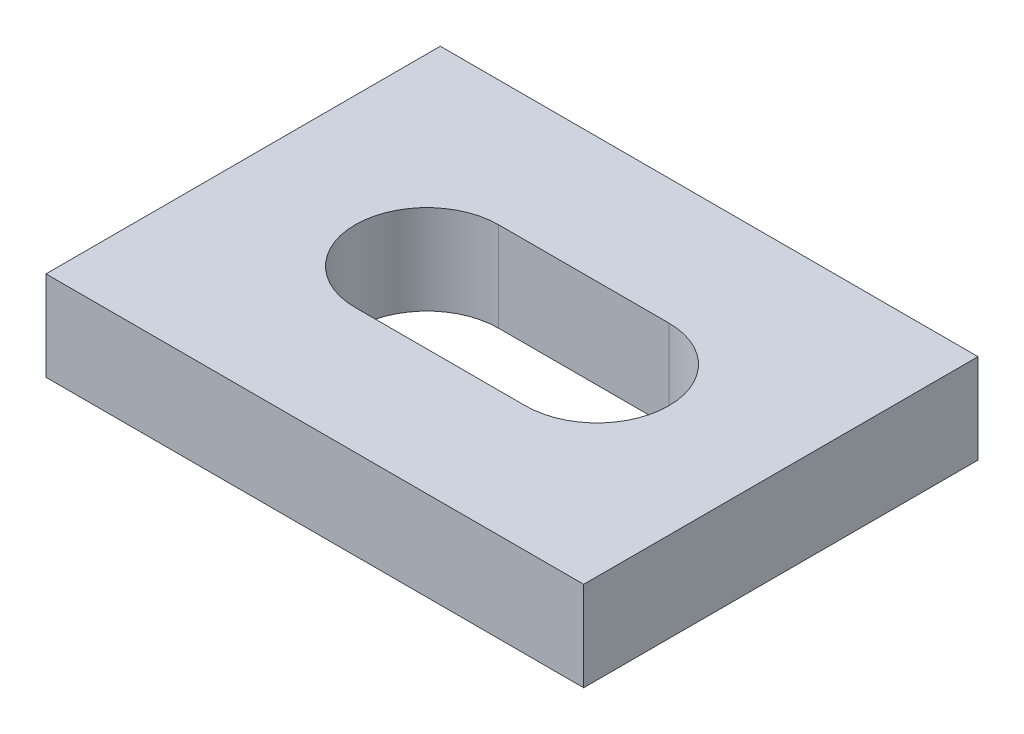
ISO-10303-21;
HEADER;
FILE_DESCRIPTION(('STEP AP214'),'2;1');
FILE_NAME('part.step','',(''),(''),'','','');
FILE_SCHEMA(('AUTOMOTIVE_DESIGN { 1 0 10303 214 1 1 1 1 }'));
ENDSEC;
DATA;
#1=APPLICATION_CONTEXT('core data for automotive mechanical design processes');
#2=APPLICATION_PROTOCOL_DEFINITION('international standard','automotive_design',2000,#1);
#3=PRODUCT_CONTEXT('',#1,'mechanical');
#4=PRODUCT('Part','Part','',(#3));
#5=PRODUCT_RELATED_PRODUCT_CATEGORY('part','',(#4));
#6=PRODUCT_DEFINITION_FORMATION('','',#4);
#7=PRODUCT_DEFINITION_CONTEXT('part definition',#1,'design');
#8=PRODUCT_DEFINITION('design','',#6,#7);
#9=PRODUCT_DEFINITION_SHAPE('','',#8);
#10=(LENGTH_UNIT() NAMED_UNIT(*) SI_UNIT(.MILLI.,.METRE.));
#11=(NAMED_UNIT(*) PLANE_ANGLE_UNIT() SI_UNIT($,.RADIAN.));
#12=(NAMED_UNIT(*) SI_UNIT($,.STERADIAN.) SOLID_ANGLE_UNIT());
#13=UNCERTAINTY_MEASURE_WITH_UNIT(LENGTH_MEASURE(1.E-05),#10,'distance_accuracy_value','');
#14=(GEOMETRIC_REPRESENTATION_CONTEXT(3) GLOBAL_UNCERTAINTY_ASSIGNED_CONTEXT((#13)) GLOBAL_UNIT_ASSIGNED_CONTEXT((#10,
#11,#12)) REPRESENTATION_CONTEXT('',''));
#15=CARTESIAN_POINT('',(0.,0.,0.));
#16=DIRECTION('',(0.,0.,1.));
#17=DIRECTION('',(1.,0.,0.));
#18=AXIS2_PLACEMENT_3D('',#15,#16,#17);
#19=CARTESIAN_POINT('',(-30.,10.,22.));
#20=DIRECTION('',(1.,0.,0.));
#21=DIRECTION('',(0.,0.,-1.));
#22=AXIS2_PLACEMENT_3D('',#19,#20,#21);
#23=PLANE('',#22);
#24=DIRECTION('',(0.,0.,1.));
#25=VECTOR('',#24,1.);
#26=CARTESIAN_POINT('',(-30.,0.,22.));
#27=LINE('',#26,#25);
#28=CARTESIAN_POINT('',(-30.,0.,-22.));
#29=VERTEX_POINT('',#28);
#30=CARTESIAN_POINT('',(-30.,0.,22.));
#31=VERTEX_POINT('',#30);
#32=EDGE_CURVE('E102',#29,#31,#27,.T.);
#33=ORIENTED_EDGE('',*,*,#32,.T.);
#34=DIRECTION('',(0.,-1.,0.));
#35=VECTOR('',#34,1.);
#36=CARTESIAN_POINT('',(-30.,10.,22.));
#37=LINE('',#36,#35);
#38=CARTESIAN_POINT('',(-30.,10.,22.));
#39=VERTEX_POINT('',#38);
#40=EDGE_CURVE('E11',#39,#31,#37,.T.);
#41=ORIENTED_EDGE('',*,*,#40,.F.);
#42=DIRECTION('',(0.,0.,1.));
#43=VECTOR('',#42,1.);
#44=CARTESIAN_POINT('',(-30.,10.,22.));
#45=LINE('',#44,#43);
#46=CARTESIAN_POINT('',(-30.,10.,-22.));
#47=VERTEX_POINT('',#46);
#48=EDGE_CURVE('E139',#47,#39,#45,.T.);
#49=ORIENTED_EDGE('',*,*,#48,.F.);
#50=DIRECTION('',(0.,-1.,0.));
#51=VECTOR('',#50,1.);
#52=CARTESIAN_POINT('',(-30.,10.,-22.));
#53=LINE('',#52,#51);
#54=EDGE_CURVE('E148',#47,#29,#53,.T.);
#55=ORIENTED_EDGE('',*,*,#54,.T.);
#56=EDGE_LOOP('',(#33,#41,#49,#55));
#57=FACE_BOUND('',#56,.T.);
#58=ADVANCED_FACE('F32',(#57),#23,.F.);
#59=CARTESIAN_POINT('',(-30.,10.,22.));
#60=DIRECTION('',(0.,0.,-1.));
#61=DIRECTION('',(-1.,0.,0.));
#62=AXIS2_PLACEMENT_3D('',#59,#60,#61);
#63=PLANE('',#62);
#64=DIRECTION('',(1.,0.,0.));
#65=VECTOR('',#64,1.);
#66=CARTESIAN_POINT('',(-30.,0.,22.));
#67=LINE('',#66,#65);
#68=CARTESIAN_POINT('',(30.,0.,22.));
#69=VERTEX_POINT('',#68);
#70=EDGE_CURVE('E133',#31,#69,#67,.T.);
#71=ORIENTED_EDGE('',*,*,#70,.T.);
#72=DIRECTION('',(0.,-1.,0.));
#73=VECTOR('',#72,1.);
#74=CARTESIAN_POINT('',(30.,10.,22.));
#75=LINE('',#74,#73);
#76=CARTESIAN_POINT('',(30.,10.,22.));
#77=VERTEX_POINT('',#76);
#78=EDGE_CURVE('E39',#77,#69,#75,.T.);
#79=ORIENTED_EDGE('',*,*,#78,.F.);
#80=DIRECTION('',(1.,0.,0.));
#81=VECTOR('',#80,1.);
#82=CARTESIAN_POINT('',(-30.,10.,22.));
#83=LINE('',#82,#81);
#84=EDGE_CURVE('E142',#39,#77,#83,.T.);
#85=ORIENTED_EDGE('',*,*,#84,.F.);
#86=ORIENTED_EDGE('',*,*,#40,.T.);
#87=EDGE_LOOP('',(#71,#79,#85,#86));
#88=FACE_BOUND('',#87,.T.);
#89=ADVANCED_FACE('F172',(#88),#63,.F.);
#90=CARTESIAN_POINT('',(30.,10.,22.));
#91=DIRECTION('',(-1.,0.,0.));
#92=DIRECTION('',(0.,0.,1.));
#93=AXIS2_PLACEMENT_3D('',#90,#91,#92);
#94=PLANE('',#93);
#95=DIRECTION('',(0.,0.,-1.));
#96=VECTOR('',#95,1.);
#97=CARTESIAN_POINT('',(30.,0.,22.));
#98=LINE('',#97,#96);
#99=CARTESIAN_POINT('',(30.,0.,-22.));
#100=VERTEX_POINT('',#99);
#101=EDGE_CURVE('E135',#69,#100,#98,.T.);
#102=ORIENTED_EDGE('',*,*,#101,.T.);
#103=DIRECTION('',(0.,-1.,0.));
#104=VECTOR('',#103,1.);
#105=CARTESIAN_POINT('',(30.,10.,-22.));
#106=LINE('',#105,#104);
#107=CARTESIAN_POINT('',(30.,10.,-22.));
#108=VERTEX_POINT('',#107);
#109=EDGE_CURVE('E151',#108,#100,#106,.T.);
#110=ORIENTED_EDGE('',*,*,#109,.F.);
#111=DIRECTION('',(0.,0.,-1.));
#112=VECTOR('',#111,1.);
#113=CARTESIAN_POINT('',(30.,10.,22.));
#114=LINE('',#113,#112);
#115=EDGE_CURVE('E144',#77,#108,#114,.T.);
#116=ORIENTED_EDGE('',*,*,#115,.F.);
#117=ORIENTED_EDGE('',*,*,#78,.T.);
#118=EDGE_LOOP('',(#102,#110,#116,#117));
#119=FACE_BOUND('',#118,.T.);
#120=ADVANCED_FACE('F158',(#119),#94,.F.);
#121=CARTESIAN_POINT('',(-30.,10.,-22.));
#122=DIRECTION('',(0.,0.,1.));
#123=DIRECTION('',(1.,0.,0.));
#124=AXIS2_PLACEMENT_3D('',#121,#122,#123);
#125=PLANE('',#124);
#126=DIRECTION('',(-1.,0.,0.));
#127=VECTOR('',#126,1.);
#128=CARTESIAN_POINT('',(-30.,0.,-22.));
#129=LINE('',#128,#127);
#130=EDGE_CURVE('E137',#100,#29,#129,.T.);
#131=ORIENTED_EDGE('',*,*,#130,.T.);
#132=ORIENTED_EDGE('',*,*,#54,.F.);
#133=DIRECTION('',(-1.,0.,0.));
#134=VECTOR('',#133,1.);
#135=CARTESIAN_POINT('',(-30.,10.,-22.));
#136=LINE('',#135,#134);
#137=EDGE_CURVE('E146',#108,#47,#136,.T.);
#138=ORIENTED_EDGE('',*,*,#137,.F.);
#139=ORIENTED_EDGE('',*,*,#109,.T.);
#140=EDGE_LOOP('',(#131,#132,#138,#139));
#141=FACE_BOUND('',#140,.T.);
#142=ADVANCED_FACE('F165',(#141),#125,.F.);
#143=CARTESIAN_POINT('',(-30.,10.,22.));
#144=DIRECTION('',(0.,-1.,0.));
#145=DIRECTION('',(0.,0.,-1.));
#146=AXIS2_PLACEMENT_3D('',#143,#144,#145);
#147=PLANE('',#146);
#148=DIRECTION('',(-1.,0.,0.));
#149=VECTOR('',#148,1.);
#150=CARTESIAN_POINT('',(9.50000000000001,9.99999999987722,-7.99999999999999));
#151=LINE('',#150,#149);
#152=CARTESIAN_POINT('',(9.50000000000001,10.,-7.99999999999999));
#153=VERTEX_POINT('',#152);
#154=CARTESIAN_POINT('',(-9.49999999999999,9.99999999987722,-8.));
#155=VERTEX_POINT('',#154);
#156=EDGE_CURVE('E115',#153,#155,#151,.T.);
#157=ORIENTED_EDGE('',*,*,#156,.F.);
#158=CARTESIAN_POINT('',(9.50000000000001,9.99999999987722,0.));
#159=DIRECTION('',(0.,1.,0.));
#160=DIRECTION('',(0.,0.,1.));
#161=AXIS2_PLACEMENT_3D('',#158,#159,#160);
#162=CIRCLE('',#161,8.);
#163=CARTESIAN_POINT('',(9.50000000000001,9.99999999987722,8.00000000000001));
#164=VERTEX_POINT('',#163);
#165=EDGE_CURVE('E46',#164,#153,#162,.T.);
#166=ORIENTED_EDGE('',*,*,#165,.F.);
#167=DIRECTION('',(1.,0.,0.));
#168=VECTOR('',#167,1.);
#169=CARTESIAN_POINT('',(-9.5,9.99999999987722,8.));
#170=LINE('',#169,#168);
#171=CARTESIAN_POINT('',(-9.49999999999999,9.99999999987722,8.));
#172=VERTEX_POINT('',#171);
#173=EDGE_CURVE('E108',#172,#164,#170,.T.);
#174=ORIENTED_EDGE('',*,*,#173,.F.);
#175=CARTESIAN_POINT('',(-9.49999999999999,9.99999999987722,0.));
#176=DIRECTION('',(0.,1.,0.));
#177=DIRECTION('',(0.,0.,1.));
#178=AXIS2_PLACEMENT_3D('',#175,#176,#177);
#179=CIRCLE('',#178,8.);
#180=EDGE_CURVE('E122',#155,#172,#179,.T.);
#181=ORIENTED_EDGE('',*,*,#180,.F.);
#182=EDGE_LOOP('',(#157,#166,#174,#181));
#183=FACE_BOUND('',#182,.T.);
#184=ORIENTED_EDGE('',*,*,#48,.T.);
#185=ORIENTED_EDGE('',*,*,#84,.T.);
#186=ORIENTED_EDGE('',*,*,#115,.T.);
#187=ORIENTED_EDGE('',*,*,#137,.T.);
#188=EDGE_LOOP('',(#184,#185,#186,#187));
#189=FACE_BOUND('',#188,.T.);
#190=ADVANCED_FACE('F171',(#183,#189),#147,.F.);
#191=CARTESIAN_POINT('',(-30.,0.,22.));
#192=DIRECTION('',(0.,-1.,0.));
#193=DIRECTION('',(0.,0.,-1.));
#194=AXIS2_PLACEMENT_3D('',#191,#192,#193);
#195=PLANE('',#194);
#196=CARTESIAN_POINT('',(9.50000000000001,0.,0.));
#197=DIRECTION('',(0.,-1.,0.));
#198=DIRECTION('',(0.,0.,-1.));
#199=AXIS2_PLACEMENT_3D('',#196,#197,#198);
#200=CIRCLE('',#199,8.);
#201=CARTESIAN_POINT('',(9.50000000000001,0.,8.00000000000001));
#202=VERTEX_POINT('',#201);
#203=CARTESIAN_POINT('',(9.50000000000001,0.,-7.99999999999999));
#204=VERTEX_POINT('',#203);
#205=EDGE_CURVE('E106',#202,#204,#200,.F.);
#206=ORIENTED_EDGE('',*,*,#205,.T.);
#207=DIRECTION('',(-1.,0.,0.));
#208=VECTOR('',#207,1.);
#209=CARTESIAN_POINT('',(9.50000000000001,0.,-7.99999999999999));
#210=LINE('',#209,#208);
#211=CARTESIAN_POINT('',(-9.49999999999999,0.,-8.));
#212=VERTEX_POINT('',#211);
#213=EDGE_CURVE('E95',#204,#212,#210,.T.);
#214=ORIENTED_EDGE('',*,*,#213,.T.);
#215=CARTESIAN_POINT('',(-9.49999999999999,0.,0.));
#216=DIRECTION('',(0.,-1.,0.));
#217=DIRECTION('',(0.,0.,-1.));
#218=AXIS2_PLACEMENT_3D('',#215,#216,#217);
#219=CIRCLE('',#218,8.);
#220=CARTESIAN_POINT('',(-9.49999999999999,0.,8.));
#221=VERTEX_POINT('',#220);
#222=EDGE_CURVE('E117',#212,#221,#219,.F.);
#223=ORIENTED_EDGE('',*,*,#222,.T.);
#224=DIRECTION('',(1.,0.,0.));
#225=VECTOR('',#224,1.);
#226=CARTESIAN_POINT('',(-9.5,0.,8.));
#227=LINE('',#226,#225);
#228=EDGE_CURVE('E113',#221,#202,#227,.T.);
#229=ORIENTED_EDGE('',*,*,#228,.T.);
#230=EDGE_LOOP('',(#206,#214,#223,#229));
#231=FACE_BOUND('',#230,.T.);
#232=ORIENTED_EDGE('',*,*,#32,.F.);
#233=ORIENTED_EDGE('',*,*,#130,.F.);
#234=ORIENTED_EDGE('',*,*,#101,.F.);
#235=ORIENTED_EDGE('',*,*,#70,.F.);
#236=EDGE_LOOP('',(#232,#233,#234,#235));
#237=FACE_BOUND('',#236,.T.);
#238=ADVANCED_FACE('F111',(#231,#237),#195,.T.);
#239=CARTESIAN_POINT('',(9.50000000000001,-0.000999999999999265,0.));
#240=DIRECTION('',(0.,1.,0.));
#241=DIRECTION('',(0.,0.,1.));
#242=AXIS2_PLACEMENT_3D('',#239,#240,#241);
#243=CYLINDRICAL_SURFACE('',#242,8.);
#244=DIRECTION('',(0.,1.,0.));
#245=VECTOR('',#244,1.);
#246=CARTESIAN_POINT('',(9.50000000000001,-0.000999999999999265,8.00000000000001));
#247=LINE('',#246,#245);
#248=EDGE_CURVE('E103',#202,#164,#247,.T.);
#249=ORIENTED_EDGE('',*,*,#248,.T.);
#250=ORIENTED_EDGE('',*,*,#165,.T.);
#251=DIRECTION('',(0.,1.,0.));
#252=VECTOR('',#251,1.);
#253=CARTESIAN_POINT('',(9.50000000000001,-0.000999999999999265,-7.99999999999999));
#254=LINE('',#253,#252);
#255=EDGE_CURVE('E97',#204,#153,#254,.T.);
#256=ORIENTED_EDGE('',*,*,#255,.F.);
#257=ORIENTED_EDGE('',*,*,#205,.F.);
#258=EDGE_LOOP('',(#249,#250,#256,#257));
#259=FACE_BOUND('',#258,.T.);
#260=ADVANCED_FACE('F105',(#259),#243,.F.);
#261=CARTESIAN_POINT('',(-9.5,-0.000999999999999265,8.));
#262=DIRECTION('',(0.,0.,1.));
#263=DIRECTION('',(1.,0.,0.));
#264=AXIS2_PLACEMENT_3D('',#261,#262,#263);
#265=PLANE('',#264);
#266=DIRECTION('',(0.,1.,0.));
#267=VECTOR('',#266,1.);
#268=CARTESIAN_POINT('',(-9.49999999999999,-0.000999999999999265,8.));
#269=LINE('',#268,#267);
#270=EDGE_CURVE('E128',#221,#172,#269,.T.);
#271=ORIENTED_EDGE('',*,*,#270,.T.);
#272=ORIENTED_EDGE('',*,*,#173,.T.);
#273=ORIENTED_EDGE('',*,*,#248,.F.);
#274=ORIENTED_EDGE('',*,*,#228,.F.);
#275=EDGE_LOOP('',(#271,#272,#273,#274));
#276=FACE_BOUND('',#275,.T.);
#277=ADVANCED_FACE('F189',(#276),#265,.F.);
#278=CARTESIAN_POINT('',(-9.49999999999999,-0.000999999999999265,0.));
#279=DIRECTION('',(0.,1.,0.));
#280=DIRECTION('',(0.,0.,1.));
#281=AXIS2_PLACEMENT_3D('',#278,#279,#280);
#282=CYLINDRICAL_SURFACE('',#281,8.);
#283=DIRECTION('',(0.,1.,0.));
#284=VECTOR('',#283,1.);
#285=CARTESIAN_POINT('',(-9.49999999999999,-0.000999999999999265,-8.));
#286=LINE('',#285,#284);
#287=EDGE_CURVE('E54',#212,#155,#286,.T.);
#288=ORIENTED_EDGE('',*,*,#287,.T.);
#289=ORIENTED_EDGE('',*,*,#180,.T.);
#290=ORIENTED_EDGE('',*,*,#270,.F.);
#291=ORIENTED_EDGE('',*,*,#222,.F.);
#292=EDGE_LOOP('',(#288,#289,#290,#291));
#293=FACE_BOUND('',#292,.T.);
#294=ADVANCED_FACE('F192',(#293),#282,.F.);
#295=CARTESIAN_POINT('',(9.50000000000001,-0.000999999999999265,-7.99999999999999));
#296=DIRECTION('',(0.,0.,-1.));
#297=DIRECTION('',(-1.,0.,0.));
#298=AXIS2_PLACEMENT_3D('',#295,#296,#297);
#299=PLANE('',#298);
#300=ORIENTED_EDGE('',*,*,#255,.T.);
#301=ORIENTED_EDGE('',*,*,#156,.T.);
#302=ORIENTED_EDGE('',*,*,#287,.F.);
#303=ORIENTED_EDGE('',*,*,#213,.F.);
#304=EDGE_LOOP('',(#300,#301,#302,#303));
#305=FACE_BOUND('',#304,.T.);
#306=ADVANCED_FACE('F96',(#305),#299,.F.);
#307=CLOSED_SHELL('',(#58,#89,#120,#142,#190,#238,#260,#277,#294,#306));
#308=MANIFOLD_SOLID_BREP('B2',#307);
#309=ADVANCED_BREP_SHAPE_REPRESENTATION('',(#18,#308),#14);
#310=SHAPE_DEFINITION_REPRESENTATION(#9,#309);
ENDSEC;
END-ISO-10303-21;
